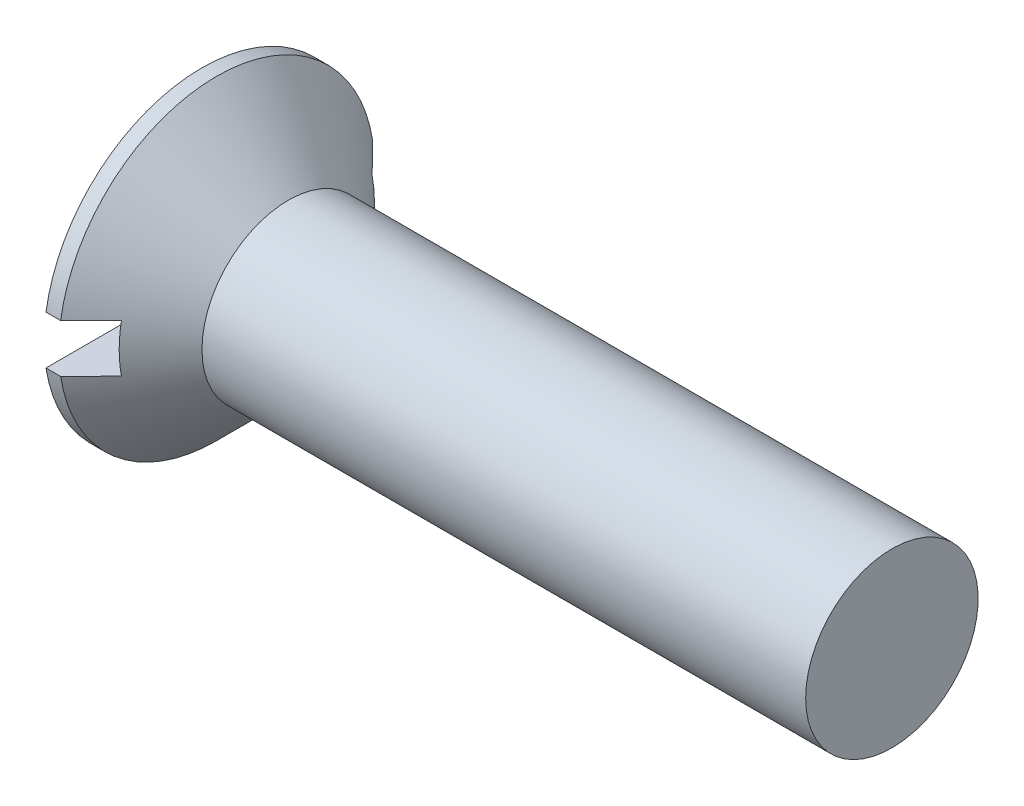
from build123d import *

# Parameters (mm, degrees)
SKETCH2_W         = 18.3
SKETCH2_H         = 2.8
SLOT_DEPTH        = 2.6
CIRPATTERN1_COUNT = 2
CIRPATTERN1_ANGLE = 90


with BuildPart() as part:
    # BodySke → Base-Revolve (revolve)
    with BuildSketch(Plane.XY, mode=Mode.PRIVATE) as base_revolve_sk:
        Polygon((0, 0), (0, 9.15), (0.85, 9.15), (5, 5), (40, 5), (40, 0), align=None)
    revolve(base_revolve_sk.sketch.rotate(Axis((-6.35, 0, 0), (1, 0, 0)), 90), axis=Axis((-6.35, 0, 0), (1, 0, 0)))

    # Sketch2 → Slot (cut)
    with BuildSketch(Plane.ZY):
        Rectangle(SKETCH2_W, SKETCH2_H)
    extrude(amount=-SLOT_DEPTH, mode=Mode.SUBTRACT)

    # Sketch3 → Cross section 0
    with BuildSketch(Plane.ZY):
        with BuildLine():
            Line((-0.99, 4.94), (0.99, 4.94))
            Line((0.99, 4.94), (0.99, -4.94))
            Line((0.99, -4.94), (-0.99, -4.94))
            Line((-0.99, -4.94), (-0.99, 4.94))
        make_face()
    # Sketch4 → Cross section 1
    with BuildSketch(Plane.ZY.offset(-5.98)):
        with BuildLine():
            Line((-0.495, 0.495), (0.495, 0.495))
            Line((0.495, 0.495), (0.495, -0.495))
            Line((0.495, -0.495), (-0.495, -0.495))
            Line((-0.495, -0.495), (-0.495, 0.495))
        make_face()
    cross = loft(mode=Mode.SUBTRACT)

    # CirPattern1: Cross ×2 about axis
    cirpattern1_axis = Axis((0, 0, 0), (1, 0, 0))
    for i in range(1, CIRPATTERN1_COUNT):
        add(cross.rotate(cirpattern1_axis, i * CIRPATTERN1_ANGLE / (CIRPATTERN1_COUNT - 1)), mode=Mode.SUBTRACT)


solid = part.part
